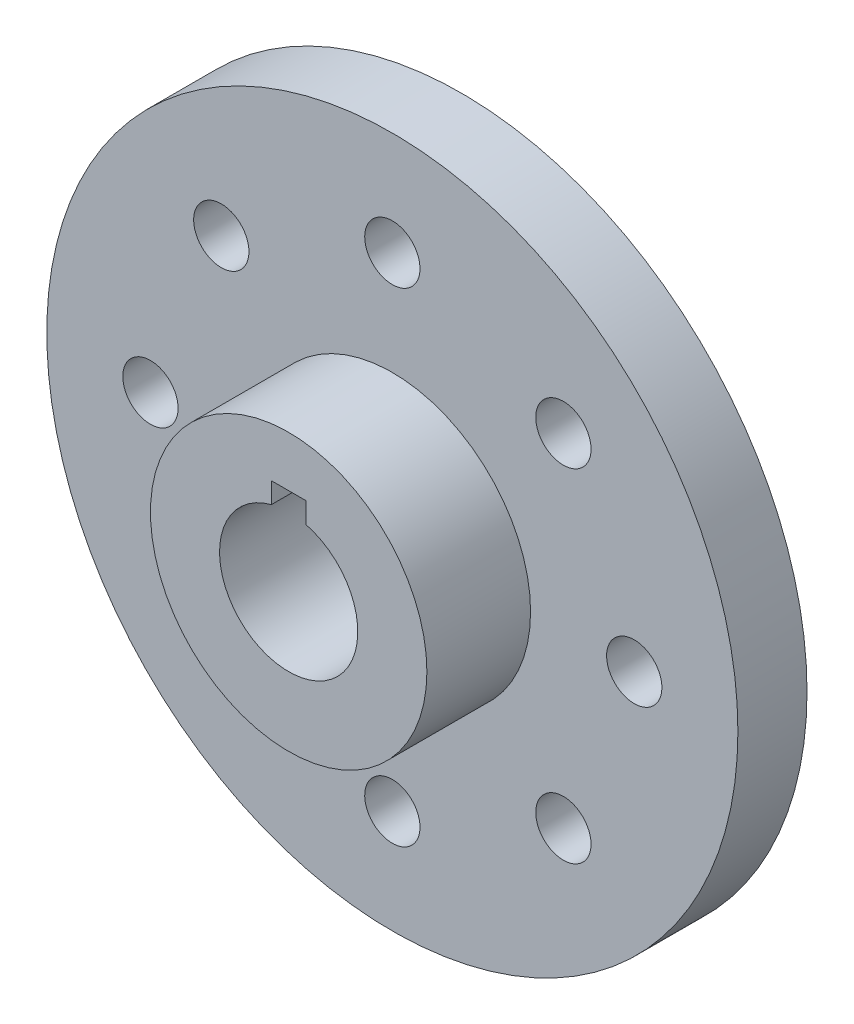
ISO-10303-21;
HEADER;
FILE_DESCRIPTION(('STEP AP214'),'2;1');
FILE_NAME('part.step','',(''),(''),'','','');
FILE_SCHEMA(('AUTOMOTIVE_DESIGN { 1 0 10303 214 1 1 1 1 }'));
ENDSEC;
DATA;
#1=APPLICATION_CONTEXT('core data for automotive mechanical design processes');
#2=APPLICATION_PROTOCOL_DEFINITION('international standard','automotive_design',2000,#1);
#3=PRODUCT_CONTEXT('',#1,'mechanical');
#4=PRODUCT('Part','Part','',(#3));
#5=PRODUCT_RELATED_PRODUCT_CATEGORY('part','',(#4));
#6=PRODUCT_DEFINITION_FORMATION('','',#4);
#7=PRODUCT_DEFINITION_CONTEXT('part definition',#1,'design');
#8=PRODUCT_DEFINITION('design','',#6,#7);
#9=PRODUCT_DEFINITION_SHAPE('','',#8);
#10=(LENGTH_UNIT() NAMED_UNIT(*) SI_UNIT(.MILLI.,.METRE.));
#11=(NAMED_UNIT(*) PLANE_ANGLE_UNIT() SI_UNIT($,.RADIAN.));
#12=(NAMED_UNIT(*) SI_UNIT($,.STERADIAN.) SOLID_ANGLE_UNIT());
#13=UNCERTAINTY_MEASURE_WITH_UNIT(LENGTH_MEASURE(1.E-05),#10,'distance_accuracy_value','');
#14=(GEOMETRIC_REPRESENTATION_CONTEXT(3) GLOBAL_UNCERTAINTY_ASSIGNED_CONTEXT((#13)) GLOBAL_UNIT_ASSIGNED_CONTEXT((#10,
#11,#12)) REPRESENTATION_CONTEXT('',''));
#15=CARTESIAN_POINT('',(0.,0.,0.));
#16=DIRECTION('',(0.,0.,1.));
#17=DIRECTION('',(1.,0.,0.));
#18=AXIS2_PLACEMENT_3D('',#15,#16,#17);
#19=CARTESIAN_POINT('',(0.,0.,0.));
#20=DIRECTION('',(0.,0.,-1.));
#21=DIRECTION('',(-1.,0.,0.));
#22=AXIS2_PLACEMENT_3D('',#19,#20,#21);
#23=PLANE('',#22);
#24=CARTESIAN_POINT('',(0.,0.,0.));
#25=DIRECTION('',(0.,0.,1.));
#26=DIRECTION('',(1.,0.,0.));
#27=AXIS2_PLACEMENT_3D('',#24,#25,#26);
#28=CIRCLE('',#27,10.);
#29=CARTESIAN_POINT('',(-2.5,9.68245836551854,0.));
#30=VERTEX_POINT('',#29);
#31=CARTESIAN_POINT('',(2.5,9.68245836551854,0.));
#32=VERTEX_POINT('',#31);
#33=EDGE_CURVE('E81',#30,#32,#28,.T.);
#34=ORIENTED_EDGE('',*,*,#33,.F.);
#35=DIRECTION('',(0.,-1.,0.));
#36=VECTOR('',#35,1.);
#37=CARTESIAN_POINT('',(-2.5,9.68245836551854,0.));
#38=LINE('',#37,#36);
#39=CARTESIAN_POINT('',(-2.5,12.6824583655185,0.));
#40=VERTEX_POINT('',#39);
#41=EDGE_CURVE('E234',#40,#30,#38,.T.);
#42=ORIENTED_EDGE('',*,*,#41,.F.);
#43=DIRECTION('',(-1.,0.,0.));
#44=VECTOR('',#43,1.);
#45=CARTESIAN_POINT('',(2.5,12.6824583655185,0.));
#46=LINE('',#45,#44);
#47=CARTESIAN_POINT('',(2.5,12.6824583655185,0.));
#48=VERTEX_POINT('',#47);
#49=EDGE_CURVE('E83',#48,#40,#46,.T.);
#50=ORIENTED_EDGE('',*,*,#49,.F.);
#51=DIRECTION('',(0.,1.,0.));
#52=VECTOR('',#51,1.);
#53=CARTESIAN_POINT('',(2.5,9.68245836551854,0.));
#54=LINE('',#53,#52);
#55=EDGE_CURVE('E68',#32,#48,#54,.T.);
#56=ORIENTED_EDGE('',*,*,#55,.F.);
#57=EDGE_LOOP('',(#34,#42,#50,#56));
#58=FACE_BOUND('',#57,.T.);
#59=CARTESIAN_POINT('',(0.,0.,0.));
#60=DIRECTION('',(0.,0.,1.));
#61=DIRECTION('',(1.,0.,0.));
#62=AXIS2_PLACEMENT_3D('',#59,#60,#61);
#63=CIRCLE('',#62,20.);
#64=CARTESIAN_POINT('',(20.,0.,0.));
#65=VERTEX_POINT('',#64);
#66=EDGE_CURVE('E11',#65,#65,#63,.T.);
#67=ORIENTED_EDGE('',*,*,#66,.T.);
#68=EDGE_LOOP('',(#67));
#69=FACE_BOUND('',#68,.T.);
#70=ADVANCED_FACE('F26',(#58,#69),#23,.F.);
#71=CARTESIAN_POINT('',(0.,0.,0.));
#72=DIRECTION('',(0.,0.,1.));
#73=DIRECTION('',(1.,0.,0.));
#74=AXIS2_PLACEMENT_3D('',#71,#72,#73);
#75=CYLINDRICAL_SURFACE('',#74,20.);
#76=ORIENTED_EDGE('',*,*,#66,.F.);
#77=EDGE_LOOP('',(#76));
#78=FACE_BOUND('',#77,.T.);
#79=CARTESIAN_POINT('',(0.,0.,-15.));
#80=DIRECTION('',(0.,0.,1.));
#81=DIRECTION('',(1.,0.,0.));
#82=AXIS2_PLACEMENT_3D('',#79,#80,#81);
#83=CIRCLE('',#82,20.);
#84=CARTESIAN_POINT('',(20.,0.,-15.));
#85=VERTEX_POINT('',#84);
#86=EDGE_CURVE('E33',#85,#85,#83,.T.);
#87=ORIENTED_EDGE('',*,*,#86,.T.);
#88=EDGE_LOOP('',(#87));
#89=FACE_BOUND('',#88,.T.);
#90=ADVANCED_FACE('F103',(#78,#89),#75,.T.);
#91=CARTESIAN_POINT('',(0.,20.,-15.));
#92=DIRECTION('',(0.,0.,-1.));
#93=DIRECTION('',(-1.,0.,0.));
#94=AXIS2_PLACEMENT_3D('',#91,#92,#93);
#95=PLANE('',#94);
#96=CARTESIAN_POINT('',(35.,4.92661467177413E-13,-15.));
#97=DIRECTION('',(0.,0.,1.));
#98=DIRECTION('',(0.707106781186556,-0.707106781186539,0.));
#99=AXIS2_PLACEMENT_3D('',#96,#97,#98);
#100=CIRCLE('',#99,4.);
#101=CARTESIAN_POINT('',(37.8284271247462,-2.82842712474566,-15.));
#102=VERTEX_POINT('',#101);
#103=EDGE_CURVE('E244',#102,#102,#100,.T.);
#104=ORIENTED_EDGE('',*,*,#103,.F.);
#105=EDGE_LOOP('',(#104));
#106=FACE_BOUND('',#105,.T.);
#107=CARTESIAN_POINT('',(24.7487373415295,-24.7487373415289,-15.));
#108=DIRECTION('',(0.,0.,1.));
#109=DIRECTION('',(0.,-1.,0.));
#110=AXIS2_PLACEMENT_3D('',#107,#108,#109);
#111=CIRCLE('',#110,4.);
#112=CARTESIAN_POINT('',(24.7487373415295,-28.7487373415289,-15.));
#113=VERTEX_POINT('',#112);
#114=EDGE_CURVE('E251',#113,#113,#111,.T.);
#115=ORIENTED_EDGE('',*,*,#114,.F.);
#116=EDGE_LOOP('',(#115));
#117=FACE_BOUND('',#116,.T.);
#118=CARTESIAN_POINT('',(3.71230823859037E-13,-35.,-15.));
#119=DIRECTION('',(0.,0.,1.));
#120=DIRECTION('',(-0.707106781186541,-0.707106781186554,0.));
#121=AXIS2_PLACEMENT_3D('',#118,#119,#120);
#122=CIRCLE('',#121,4.);
#123=CARTESIAN_POINT('',(-2.82842712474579,-37.8284271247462,-15.));
#124=VERTEX_POINT('',#123);
#125=EDGE_CURVE('E257',#124,#124,#122,.T.);
#126=ORIENTED_EDGE('',*,*,#125,.F.);
#127=EDGE_LOOP('',(#126));
#128=FACE_BOUND('',#127,.T.);
#129=CARTESIAN_POINT('',(-24.7487373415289,-24.7487373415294,-15.));
#130=DIRECTION('',(0.,0.,1.));
#131=DIRECTION('',(-1.,0.,0.));
#132=AXIS2_PLACEMENT_3D('',#129,#130,#131);
#133=CIRCLE('',#132,4.);
#134=CARTESIAN_POINT('',(-28.7487373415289,-24.7487373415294,-15.));
#135=VERTEX_POINT('',#134);
#136=EDGE_CURVE('E263',#135,#135,#133,.T.);
#137=ORIENTED_EDGE('',*,*,#136,.F.);
#138=EDGE_LOOP('',(#137));
#139=FACE_BOUND('',#138,.T.);
#140=CARTESIAN_POINT('',(-35.,-2.4980018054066E-13,-15.));
#141=DIRECTION('',(0.,0.,1.));
#142=DIRECTION('',(-0.707106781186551,0.707106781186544,0.));
#143=AXIS2_PLACEMENT_3D('',#140,#141,#142);
#144=CIRCLE('',#143,4.);
#145=CARTESIAN_POINT('',(-37.8284271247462,2.82842712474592,-15.));
#146=VERTEX_POINT('',#145);
#147=EDGE_CURVE('E269',#146,#146,#144,.T.);
#148=ORIENTED_EDGE('',*,*,#147,.F.);
#149=EDGE_LOOP('',(#148));
#150=FACE_BOUND('',#149,.T.);
#151=CARTESIAN_POINT('',(-24.7487373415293,24.748737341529,-15.));
#152=DIRECTION('',(0.,0.,1.));
#153=DIRECTION('',(0.,1.,0.));
#154=AXIS2_PLACEMENT_3D('',#151,#152,#153);
#155=CIRCLE('',#154,4.);
#156=CARTESIAN_POINT('',(-24.7487373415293,28.748737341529,-15.));
#157=VERTEX_POINT('',#156);
#158=EDGE_CURVE('E275',#157,#157,#155,.T.);
#159=ORIENTED_EDGE('',*,*,#158,.F.);
#160=EDGE_LOOP('',(#159));
#161=FACE_BOUND('',#160,.T.);
#162=CARTESIAN_POINT('',(-1.28369537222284E-13,35.,-15.));
#163=DIRECTION('',(0.,0.,1.));
#164=DIRECTION('',(0.707106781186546,0.707106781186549,0.));
#165=AXIS2_PLACEMENT_3D('',#162,#163,#164);
#166=CIRCLE('',#165,4.);
#167=CARTESIAN_POINT('',(2.82842712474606,37.8284271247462,-15.));
#168=VERTEX_POINT('',#167);
#169=EDGE_CURVE('E281',#168,#168,#166,.T.);
#170=ORIENTED_EDGE('',*,*,#169,.F.);
#171=EDGE_LOOP('',(#170));
#172=FACE_BOUND('',#171,.T.);
#173=CARTESIAN_POINT('',(24.7487373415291,24.7487373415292,-15.));
#174=DIRECTION('',(0.,0.,1.));
#175=DIRECTION('',(1.,0.,0.));
#176=AXIS2_PLACEMENT_3D('',#173,#174,#175);
#177=CIRCLE('',#176,4.);
#178=CARTESIAN_POINT('',(28.7487373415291,24.7487373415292,-15.));
#179=VERTEX_POINT('',#178);
#180=EDGE_CURVE('E92',#179,#179,#177,.T.);
#181=ORIENTED_EDGE('',*,*,#180,.F.);
#182=EDGE_LOOP('',(#181));
#183=FACE_BOUND('',#182,.T.);
#184=ORIENTED_EDGE('',*,*,#86,.F.);
#185=EDGE_LOOP('',(#184));
#186=FACE_BOUND('',#185,.T.);
#187=CARTESIAN_POINT('',(0.,0.,-15.));
#188=DIRECTION('',(0.,0.,1.));
#189=DIRECTION('',(1.,0.,0.));
#190=AXIS2_PLACEMENT_3D('',#187,#188,#189);
#191=CIRCLE('',#190,50.);
#192=CARTESIAN_POINT('',(50.,0.,-15.));
#193=VERTEX_POINT('',#192);
#194=EDGE_CURVE('E98',#193,#193,#191,.T.);
#195=ORIENTED_EDGE('',*,*,#194,.T.);
#196=EDGE_LOOP('',(#195));
#197=FACE_BOUND('',#196,.T.);
#198=ADVANCED_FACE('F105',(#106,#117,#128,#139,#150,#161,#172,#183,#186,#197),#95,.F.);
#199=CARTESIAN_POINT('',(0.,0.,0.));
#200=DIRECTION('',(0.,0.,1.));
#201=DIRECTION('',(1.,0.,0.));
#202=AXIS2_PLACEMENT_3D('',#199,#200,#201);
#203=CYLINDRICAL_SURFACE('',#202,50.);
#204=ORIENTED_EDGE('',*,*,#194,.F.);
#205=EDGE_LOOP('',(#204));
#206=FACE_BOUND('',#205,.T.);
#207=CARTESIAN_POINT('',(0.,0.,-25.));
#208=DIRECTION('',(0.,0.,1.));
#209=DIRECTION('',(1.,0.,0.));
#210=AXIS2_PLACEMENT_3D('',#207,#208,#209);
#211=CIRCLE('',#210,50.);
#212=CARTESIAN_POINT('',(50.,0.,-25.));
#213=VERTEX_POINT('',#212);
#214=EDGE_CURVE('E89',#213,#213,#211,.T.);
#215=ORIENTED_EDGE('',*,*,#214,.T.);
#216=EDGE_LOOP('',(#215));
#217=FACE_BOUND('',#216,.T.);
#218=ADVANCED_FACE('F108',(#206,#217),#203,.T.);
#219=CARTESIAN_POINT('',(0.,50.,-25.));
#220=DIRECTION('',(0.,0.,1.));
#221=DIRECTION('',(1.,0.,0.));
#222=AXIS2_PLACEMENT_3D('',#219,#220,#221);
#223=PLANE('',#222);
#224=CARTESIAN_POINT('',(35.,4.92661467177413E-13,-25.));
#225=DIRECTION('',(0.,0.,1.));
#226=DIRECTION('',(0.707106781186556,-0.707106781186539,0.));
#227=AXIS2_PLACEMENT_3D('',#224,#225,#226);
#228=CIRCLE('',#227,4.);
#229=CARTESIAN_POINT('',(37.8284271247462,-2.82842712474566,-25.));
#230=VERTEX_POINT('',#229);
#231=EDGE_CURVE('E249',#230,#230,#228,.T.);
#232=ORIENTED_EDGE('',*,*,#231,.T.);
#233=EDGE_LOOP('',(#232));
#234=FACE_BOUND('',#233,.T.);
#235=CARTESIAN_POINT('',(24.7487373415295,-24.7487373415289,-25.));
#236=DIRECTION('',(0.,0.,1.));
#237=DIRECTION('',(0.,-1.,0.));
#238=AXIS2_PLACEMENT_3D('',#235,#236,#237);
#239=CIRCLE('',#238,4.);
#240=CARTESIAN_POINT('',(24.7487373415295,-28.7487373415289,-25.));
#241=VERTEX_POINT('',#240);
#242=EDGE_CURVE('E254',#241,#241,#239,.T.);
#243=ORIENTED_EDGE('',*,*,#242,.T.);
#244=EDGE_LOOP('',(#243));
#245=FACE_BOUND('',#244,.T.);
#246=CARTESIAN_POINT('',(3.71230823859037E-13,-35.,-25.));
#247=DIRECTION('',(0.,0.,1.));
#248=DIRECTION('',(-0.707106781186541,-0.707106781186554,0.));
#249=AXIS2_PLACEMENT_3D('',#246,#247,#248);
#250=CIRCLE('',#249,4.);
#251=CARTESIAN_POINT('',(-2.82842712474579,-37.8284271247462,-25.));
#252=VERTEX_POINT('',#251);
#253=EDGE_CURVE('E260',#252,#252,#250,.T.);
#254=ORIENTED_EDGE('',*,*,#253,.T.);
#255=EDGE_LOOP('',(#254));
#256=FACE_BOUND('',#255,.T.);
#257=CARTESIAN_POINT('',(-24.7487373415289,-24.7487373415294,-25.));
#258=DIRECTION('',(0.,0.,1.));
#259=DIRECTION('',(-1.,0.,0.));
#260=AXIS2_PLACEMENT_3D('',#257,#258,#259);
#261=CIRCLE('',#260,4.);
#262=CARTESIAN_POINT('',(-28.7487373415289,-24.7487373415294,-25.));
#263=VERTEX_POINT('',#262);
#264=EDGE_CURVE('E266',#263,#263,#261,.T.);
#265=ORIENTED_EDGE('',*,*,#264,.T.);
#266=EDGE_LOOP('',(#265));
#267=FACE_BOUND('',#266,.T.);
#268=CARTESIAN_POINT('',(-35.,-2.4980018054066E-13,-25.));
#269=DIRECTION('',(0.,0.,1.));
#270=DIRECTION('',(-0.707106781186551,0.707106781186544,0.));
#271=AXIS2_PLACEMENT_3D('',#268,#269,#270);
#272=CIRCLE('',#271,4.);
#273=CARTESIAN_POINT('',(-37.8284271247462,2.82842712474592,-25.));
#274=VERTEX_POINT('',#273);
#275=EDGE_CURVE('E272',#274,#274,#272,.T.);
#276=ORIENTED_EDGE('',*,*,#275,.T.);
#277=EDGE_LOOP('',(#276));
#278=FACE_BOUND('',#277,.T.);
#279=CARTESIAN_POINT('',(-24.7487373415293,24.748737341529,-25.));
#280=DIRECTION('',(0.,0.,1.));
#281=DIRECTION('',(0.,1.,0.));
#282=AXIS2_PLACEMENT_3D('',#279,#280,#281);
#283=CIRCLE('',#282,4.);
#284=CARTESIAN_POINT('',(-24.7487373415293,28.748737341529,-25.));
#285=VERTEX_POINT('',#284);
#286=EDGE_CURVE('E278',#285,#285,#283,.T.);
#287=ORIENTED_EDGE('',*,*,#286,.T.);
#288=EDGE_LOOP('',(#287));
#289=FACE_BOUND('',#288,.T.);
#290=CARTESIAN_POINT('',(-1.28369537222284E-13,35.,-25.));
#291=DIRECTION('',(0.,0.,1.));
#292=DIRECTION('',(0.707106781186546,0.707106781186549,0.));
#293=AXIS2_PLACEMENT_3D('',#290,#291,#292);
#294=CIRCLE('',#293,4.);
#295=CARTESIAN_POINT('',(2.82842712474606,37.8284271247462,-25.));
#296=VERTEX_POINT('',#295);
#297=EDGE_CURVE('E284',#296,#296,#294,.T.);
#298=ORIENTED_EDGE('',*,*,#297,.T.);
#299=EDGE_LOOP('',(#298));
#300=FACE_BOUND('',#299,.T.);
#301=CARTESIAN_POINT('',(24.7487373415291,24.7487373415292,-25.));
#302=DIRECTION('',(0.,0.,1.));
#303=DIRECTION('',(1.,0.,0.));
#304=AXIS2_PLACEMENT_3D('',#301,#302,#303);
#305=CIRCLE('',#304,4.);
#306=CARTESIAN_POINT('',(28.7487373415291,24.7487373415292,-25.));
#307=VERTEX_POINT('',#306);
#308=EDGE_CURVE('E87',#307,#307,#305,.T.);
#309=ORIENTED_EDGE('',*,*,#308,.T.);
#310=EDGE_LOOP('',(#309));
#311=FACE_BOUND('',#310,.T.);
#312=DIRECTION('',(-1.,0.,0.));
#313=VECTOR('',#312,1.);
#314=CARTESIAN_POINT('',(2.5,12.6824583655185,-25.));
#315=LINE('',#314,#313);
#316=CARTESIAN_POINT('',(2.5,12.6824583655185,-25.));
#317=VERTEX_POINT('',#316);
#318=CARTESIAN_POINT('',(-2.5,12.6824583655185,-25.));
#319=VERTEX_POINT('',#318);
#320=EDGE_CURVE('E237',#317,#319,#315,.T.);
#321=ORIENTED_EDGE('',*,*,#320,.T.);
#322=DIRECTION('',(0.,-1.,0.));
#323=VECTOR('',#322,1.);
#324=CARTESIAN_POINT('',(-2.5,9.68245836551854,-25.));
#325=LINE('',#324,#323);
#326=CARTESIAN_POINT('',(-2.5,9.68245836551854,-25.));
#327=VERTEX_POINT('',#326);
#328=EDGE_CURVE('E75',#319,#327,#325,.T.);
#329=ORIENTED_EDGE('',*,*,#328,.T.);
#330=CARTESIAN_POINT('',(0.,0.,-25.));
#331=DIRECTION('',(0.,0.,1.));
#332=DIRECTION('',(1.,0.,0.));
#333=AXIS2_PLACEMENT_3D('',#330,#331,#332);
#334=CIRCLE('',#333,10.);
#335=CARTESIAN_POINT('',(2.5,9.68245836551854,-25.));
#336=VERTEX_POINT('',#335);
#337=EDGE_CURVE('E86',#327,#336,#334,.T.);
#338=ORIENTED_EDGE('',*,*,#337,.T.);
#339=DIRECTION('',(0.,1.,0.));
#340=VECTOR('',#339,1.);
#341=CARTESIAN_POINT('',(2.5,9.68245836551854,-25.));
#342=LINE('',#341,#340);
#343=EDGE_CURVE('E40',#336,#317,#342,.T.);
#344=ORIENTED_EDGE('',*,*,#343,.T.);
#345=EDGE_LOOP('',(#321,#329,#338,#344));
#346=FACE_BOUND('',#345,.T.);
#347=ORIENTED_EDGE('',*,*,#214,.F.);
#348=EDGE_LOOP('',(#347));
#349=FACE_BOUND('',#348,.T.);
#350=ADVANCED_FACE('F115',(#234,#245,#256,#267,#278,#289,#300,#311,#346,#349),#223,.F.);
#351=CARTESIAN_POINT('',(0.,0.,-25.));
#352=DIRECTION('',(0.,0.,1.));
#353=DIRECTION('',(1.,0.,0.));
#354=AXIS2_PLACEMENT_3D('',#351,#352,#353);
#355=CYLINDRICAL_SURFACE('',#354,10.);
#356=ORIENTED_EDGE('',*,*,#337,.F.);
#357=DIRECTION('',(0.,0.,1.));
#358=VECTOR('',#357,1.);
#359=CARTESIAN_POINT('',(-2.5,9.68245836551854,-25.));
#360=LINE('',#359,#358);
#361=EDGE_CURVE('E48',#327,#30,#360,.T.);
#362=ORIENTED_EDGE('',*,*,#361,.T.);
#363=ORIENTED_EDGE('',*,*,#33,.T.);
#364=DIRECTION('',(0.,0.,1.));
#365=VECTOR('',#364,1.);
#366=CARTESIAN_POINT('',(2.5,9.68245836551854,-25.));
#367=LINE('',#366,#365);
#368=EDGE_CURVE('E65',#336,#32,#367,.T.);
#369=ORIENTED_EDGE('',*,*,#368,.F.);
#370=EDGE_LOOP('',(#356,#362,#363,#369));
#371=FACE_BOUND('',#370,.T.);
#372=ADVANCED_FACE('F85',(#371),#355,.F.);
#373=CARTESIAN_POINT('',(24.7487373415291,24.7487373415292,-25.));
#374=DIRECTION('',(0.,0.,1.));
#375=DIRECTION('',(1.,0.,0.));
#376=AXIS2_PLACEMENT_3D('',#373,#374,#375);
#377=CYLINDRICAL_SURFACE('',#376,4.);
#378=ORIENTED_EDGE('',*,*,#308,.F.);
#379=EDGE_LOOP('',(#378));
#380=FACE_BOUND('',#379,.T.);
#381=ORIENTED_EDGE('',*,*,#180,.T.);
#382=EDGE_LOOP('',(#381));
#383=FACE_BOUND('',#382,.T.);
#384=ADVANCED_FACE('F126',(#380,#383),#377,.F.);
#385=CARTESIAN_POINT('',(-1.28369537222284E-13,35.,-25.));
#386=DIRECTION('',(0.,0.,1.));
#387=DIRECTION('',(1.,0.,0.));
#388=AXIS2_PLACEMENT_3D('',#385,#386,#387);
#389=CYLINDRICAL_SURFACE('',#388,4.);
#390=ORIENTED_EDGE('',*,*,#297,.F.);
#391=EDGE_LOOP('',(#390));
#392=FACE_BOUND('',#391,.T.);
#393=ORIENTED_EDGE('',*,*,#169,.T.);
#394=EDGE_LOOP('',(#393));
#395=FACE_BOUND('',#394,.T.);
#396=ADVANCED_FACE('F148',(#392,#395),#389,.F.);
#397=CARTESIAN_POINT('',(-24.7487373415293,24.748737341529,-25.));
#398=DIRECTION('',(0.,0.,1.));
#399=DIRECTION('',(1.,0.,0.));
#400=AXIS2_PLACEMENT_3D('',#397,#398,#399);
#401=CYLINDRICAL_SURFACE('',#400,4.);
#402=ORIENTED_EDGE('',*,*,#286,.F.);
#403=EDGE_LOOP('',(#402));
#404=FACE_BOUND('',#403,.T.);
#405=ORIENTED_EDGE('',*,*,#158,.T.);
#406=EDGE_LOOP('',(#405));
#407=FACE_BOUND('',#406,.T.);
#408=ADVANCED_FACE('F161',(#404,#407),#401,.F.);
#409=CARTESIAN_POINT('',(-35.,-2.4980018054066E-13,-25.));
#410=DIRECTION('',(0.,0.,1.));
#411=DIRECTION('',(1.,0.,0.));
#412=AXIS2_PLACEMENT_3D('',#409,#410,#411);
#413=CYLINDRICAL_SURFACE('',#412,4.);
#414=ORIENTED_EDGE('',*,*,#275,.F.);
#415=EDGE_LOOP('',(#414));
#416=FACE_BOUND('',#415,.T.);
#417=ORIENTED_EDGE('',*,*,#147,.T.);
#418=EDGE_LOOP('',(#417));
#419=FACE_BOUND('',#418,.T.);
#420=ADVANCED_FACE('F169',(#416,#419),#413,.F.);
#421=CARTESIAN_POINT('',(-24.7487373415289,-24.7487373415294,-25.));
#422=DIRECTION('',(0.,0.,1.));
#423=DIRECTION('',(1.,0.,0.));
#424=AXIS2_PLACEMENT_3D('',#421,#422,#423);
#425=CYLINDRICAL_SURFACE('',#424,4.);
#426=ORIENTED_EDGE('',*,*,#264,.F.);
#427=EDGE_LOOP('',(#426));
#428=FACE_BOUND('',#427,.T.);
#429=ORIENTED_EDGE('',*,*,#136,.T.);
#430=EDGE_LOOP('',(#429));
#431=FACE_BOUND('',#430,.T.);
#432=ADVANCED_FACE('F177',(#428,#431),#425,.F.);
#433=CARTESIAN_POINT('',(3.71230823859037E-13,-35.,-25.));
#434=DIRECTION('',(0.,0.,1.));
#435=DIRECTION('',(1.,0.,0.));
#436=AXIS2_PLACEMENT_3D('',#433,#434,#435);
#437=CYLINDRICAL_SURFACE('',#436,4.);
#438=ORIENTED_EDGE('',*,*,#253,.F.);
#439=EDGE_LOOP('',(#438));
#440=FACE_BOUND('',#439,.T.);
#441=ORIENTED_EDGE('',*,*,#125,.T.);
#442=EDGE_LOOP('',(#441));
#443=FACE_BOUND('',#442,.T.);
#444=ADVANCED_FACE('F185',(#440,#443),#437,.F.);
#445=CARTESIAN_POINT('',(24.7487373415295,-24.7487373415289,-25.));
#446=DIRECTION('',(0.,0.,1.));
#447=DIRECTION('',(1.,0.,0.));
#448=AXIS2_PLACEMENT_3D('',#445,#446,#447);
#449=CYLINDRICAL_SURFACE('',#448,4.);
#450=ORIENTED_EDGE('',*,*,#242,.F.);
#451=EDGE_LOOP('',(#450));
#452=FACE_BOUND('',#451,.T.);
#453=ORIENTED_EDGE('',*,*,#114,.T.);
#454=EDGE_LOOP('',(#453));
#455=FACE_BOUND('',#454,.T.);
#456=ADVANCED_FACE('F193',(#452,#455),#449,.F.);
#457=CARTESIAN_POINT('',(35.,4.92661467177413E-13,-25.));
#458=DIRECTION('',(0.,0.,1.));
#459=DIRECTION('',(1.,0.,0.));
#460=AXIS2_PLACEMENT_3D('',#457,#458,#459);
#461=CYLINDRICAL_SURFACE('',#460,4.);
#462=ORIENTED_EDGE('',*,*,#231,.F.);
#463=EDGE_LOOP('',(#462));
#464=FACE_BOUND('',#463,.T.);
#465=ORIENTED_EDGE('',*,*,#103,.T.);
#466=EDGE_LOOP('',(#465));
#467=FACE_BOUND('',#466,.T.);
#468=ADVANCED_FACE('F200',(#464,#467),#461,.F.);
#469=CARTESIAN_POINT('',(-2.5,9.68245836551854,-25.));
#470=DIRECTION('',(-1.,0.,0.));
#471=DIRECTION('',(0.,0.,1.));
#472=AXIS2_PLACEMENT_3D('',#469,#470,#471);
#473=PLANE('',#472);
#474=ORIENTED_EDGE('',*,*,#41,.T.);
#475=ORIENTED_EDGE('',*,*,#361,.F.);
#476=ORIENTED_EDGE('',*,*,#328,.F.);
#477=DIRECTION('',(0.,0.,1.));
#478=VECTOR('',#477,1.);
#479=CARTESIAN_POINT('',(-2.5,12.6824583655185,-25.));
#480=LINE('',#479,#478);
#481=EDGE_CURVE('E233',#319,#40,#480,.T.);
#482=ORIENTED_EDGE('',*,*,#481,.T.);
#483=EDGE_LOOP('',(#474,#475,#476,#482));
#484=FACE_BOUND('',#483,.T.);
#485=ADVANCED_FACE('F207',(#484),#473,.F.);
#486=CARTESIAN_POINT('',(2.5,12.6824583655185,-25.));
#487=DIRECTION('',(0.,1.,0.));
#488=DIRECTION('',(0.,0.,1.));
#489=AXIS2_PLACEMENT_3D('',#486,#487,#488);
#490=PLANE('',#489);
#491=ORIENTED_EDGE('',*,*,#49,.T.);
#492=ORIENTED_EDGE('',*,*,#481,.F.);
#493=ORIENTED_EDGE('',*,*,#320,.F.);
#494=DIRECTION('',(0.,0.,1.));
#495=VECTOR('',#494,1.);
#496=CARTESIAN_POINT('',(2.5,12.6824583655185,-25.));
#497=LINE('',#496,#495);
#498=EDGE_CURVE('E74',#317,#48,#497,.T.);
#499=ORIENTED_EDGE('',*,*,#498,.T.);
#500=EDGE_LOOP('',(#491,#492,#493,#499));
#501=FACE_BOUND('',#500,.T.);
#502=ADVANCED_FACE('F217',(#501),#490,.F.);
#503=CARTESIAN_POINT('',(2.5,9.68245836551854,-25.));
#504=DIRECTION('',(1.,0.,0.));
#505=DIRECTION('',(0.,0.,-1.));
#506=AXIS2_PLACEMENT_3D('',#503,#504,#505);
#507=PLANE('',#506);
#508=ORIENTED_EDGE('',*,*,#55,.T.);
#509=ORIENTED_EDGE('',*,*,#498,.F.);
#510=ORIENTED_EDGE('',*,*,#343,.F.);
#511=ORIENTED_EDGE('',*,*,#368,.T.);
#512=EDGE_LOOP('',(#508,#509,#510,#511));
#513=FACE_BOUND('',#512,.T.);
#514=ADVANCED_FACE('F67',(#513),#507,.F.);
#515=CLOSED_SHELL('',(#70,#90,#198,#218,#350,#372,#384,#396,#408,#420,#432,#444,#456,#468,#485,
#502,#514));
#516=MANIFOLD_SOLID_BREP('B2',#515);
#517=ADVANCED_BREP_SHAPE_REPRESENTATION('',(#18,#516),#14);
#518=SHAPE_DEFINITION_REPRESENTATION(#9,#517);
ENDSEC;
END-ISO-10303-21;
